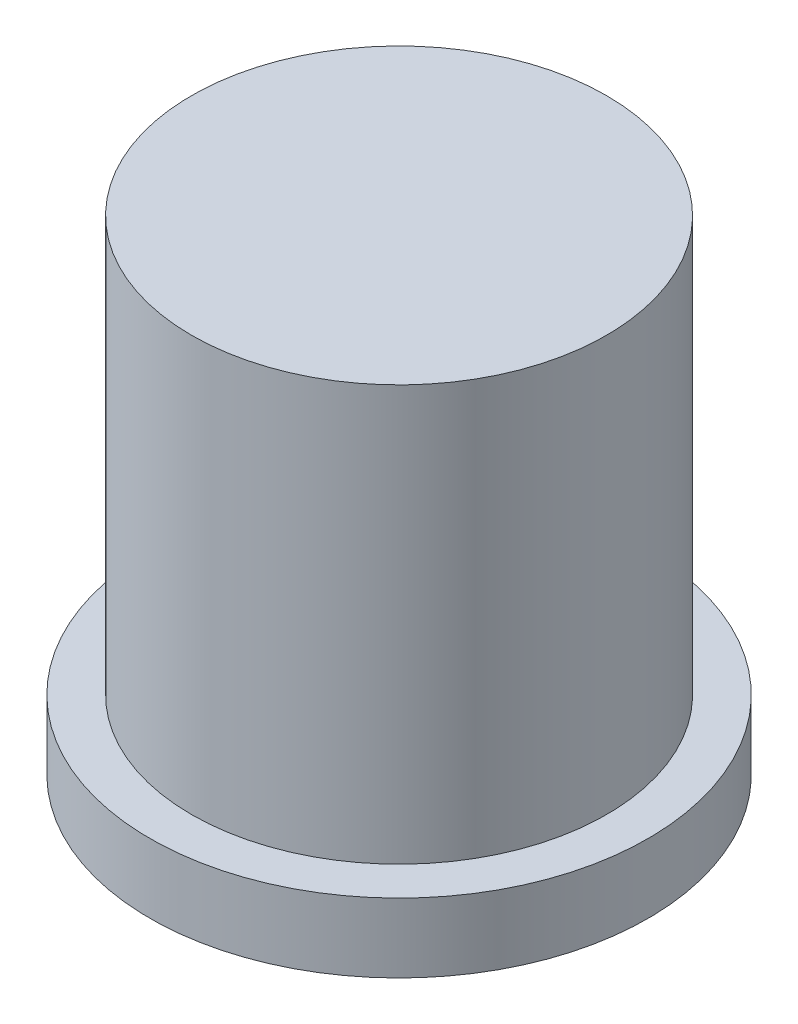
ISO-10303-21;
HEADER;
FILE_DESCRIPTION(('STEP AP214'),'2;1');
FILE_NAME('part.step','',(''),(''),'','','');
FILE_SCHEMA(('AUTOMOTIVE_DESIGN { 1 0 10303 214 1 1 1 1 }'));
ENDSEC;
DATA;
#1=APPLICATION_CONTEXT('core data for automotive mechanical design processes');
#2=APPLICATION_PROTOCOL_DEFINITION('international standard','automotive_design',2000,#1);
#3=PRODUCT_CONTEXT('',#1,'mechanical');
#4=PRODUCT('Part','Part','',(#3));
#5=PRODUCT_RELATED_PRODUCT_CATEGORY('part','',(#4));
#6=PRODUCT_DEFINITION_FORMATION('','',#4);
#7=PRODUCT_DEFINITION_CONTEXT('part definition',#1,'design');
#8=PRODUCT_DEFINITION('design','',#6,#7);
#9=PRODUCT_DEFINITION_SHAPE('','',#8);
#10=(LENGTH_UNIT() NAMED_UNIT(*) SI_UNIT(.MILLI.,.METRE.));
#11=(NAMED_UNIT(*) PLANE_ANGLE_UNIT() SI_UNIT($,.RADIAN.));
#12=(NAMED_UNIT(*) SI_UNIT($,.STERADIAN.) SOLID_ANGLE_UNIT());
#13=UNCERTAINTY_MEASURE_WITH_UNIT(LENGTH_MEASURE(1.E-05),#10,'distance_accuracy_value','');
#14=(GEOMETRIC_REPRESENTATION_CONTEXT(3) GLOBAL_UNCERTAINTY_ASSIGNED_CONTEXT((#13)) GLOBAL_UNIT_ASSIGNED_CONTEXT((#10,
#11,#12)) REPRESENTATION_CONTEXT('',''));
#15=CARTESIAN_POINT('',(0.,0.,0.));
#16=DIRECTION('',(0.,0.,1.));
#17=DIRECTION('',(1.,0.,0.));
#18=AXIS2_PLACEMENT_3D('',#15,#16,#17);
#19=CARTESIAN_POINT('',(0.,0.,0.));
#20=DIRECTION('',(0.,1.,0.));
#21=DIRECTION('',(0.,0.,1.));
#22=AXIS2_PLACEMENT_3D('',#19,#20,#21);
#23=PLANE('',#22);
#24=CARTESIAN_POINT('',(0.,0.,0.));
#25=DIRECTION('',(0.,-1.,0.));
#26=DIRECTION('',(0.,0.,-1.));
#27=AXIS2_PLACEMENT_3D('',#24,#25,#26);
#28=CIRCLE('',#27,11.43);
#29=CARTESIAN_POINT('',(0.,0.,-11.43));
#30=VERTEX_POINT('',#29);
#31=EDGE_CURVE('E10',#30,#30,#28,.T.);
#32=ORIENTED_EDGE('',*,*,#31,.T.);
#33=EDGE_LOOP('',(#32));
#34=FACE_BOUND('',#33,.T.);
#35=ADVANCED_FACE('F35',(#34),#23,.F.);
#36=CARTESIAN_POINT('',(0.,0.,0.));
#37=DIRECTION('',(0.,-1.,0.));
#38=DIRECTION('',(0.,0.,-1.));
#39=AXIS2_PLACEMENT_3D('',#36,#37,#38);
#40=CYLINDRICAL_SURFACE('',#39,11.43);
#41=ORIENTED_EDGE('',*,*,#31,.F.);
#42=EDGE_LOOP('',(#41));
#43=FACE_BOUND('',#42,.T.);
#44=CARTESIAN_POINT('',(0.,3.175,0.));
#45=DIRECTION('',(0.,-1.,0.));
#46=DIRECTION('',(0.,0.,-1.));
#47=AXIS2_PLACEMENT_3D('',#44,#45,#46);
#48=CIRCLE('',#47,11.43);
#49=CARTESIAN_POINT('',(0.,3.175,-11.43));
#50=VERTEX_POINT('',#49);
#51=EDGE_CURVE('E41',#50,#50,#48,.T.);
#52=ORIENTED_EDGE('',*,*,#51,.T.);
#53=EDGE_LOOP('',(#52));
#54=FACE_BOUND('',#53,.T.);
#55=ADVANCED_FACE('F67',(#43,#54),#40,.T.);
#56=CARTESIAN_POINT('',(-11.43,3.175,0.));
#57=DIRECTION('',(0.,-1.,0.));
#58=DIRECTION('',(0.,0.,-1.));
#59=AXIS2_PLACEMENT_3D('',#56,#57,#58);
#60=PLANE('',#59);
#61=ORIENTED_EDGE('',*,*,#51,.F.);
#62=EDGE_LOOP('',(#61));
#63=FACE_BOUND('',#62,.T.);
#64=CARTESIAN_POINT('',(0.,3.175,0.));
#65=DIRECTION('',(0.,-1.,0.));
#66=DIRECTION('',(0.,0.,-1.));
#67=AXIS2_PLACEMENT_3D('',#64,#65,#66);
#68=CIRCLE('',#67,9.525);
#69=CARTESIAN_POINT('',(0.,3.175,-9.525));
#70=VERTEX_POINT('',#69);
#71=EDGE_CURVE('E45',#70,#70,#68,.T.);
#72=ORIENTED_EDGE('',*,*,#71,.T.);
#73=EDGE_LOOP('',(#72));
#74=FACE_BOUND('',#73,.T.);
#75=ADVANCED_FACE('F63',(#63,#74),#60,.F.);
#76=CARTESIAN_POINT('',(0.,0.,0.));
#77=DIRECTION('',(0.,-1.,0.));
#78=DIRECTION('',(0.,0.,-1.));
#79=AXIS2_PLACEMENT_3D('',#76,#77,#78);
#80=CYLINDRICAL_SURFACE('',#79,9.525);
#81=ORIENTED_EDGE('',*,*,#71,.F.);
#82=EDGE_LOOP('',(#81));
#83=FACE_BOUND('',#82,.T.);
#84=CARTESIAN_POINT('',(0.,22.225,0.));
#85=DIRECTION('',(0.,-1.,0.));
#86=DIRECTION('',(0.,0.,-1.));
#87=AXIS2_PLACEMENT_3D('',#84,#85,#86);
#88=CIRCLE('',#87,9.525);
#89=CARTESIAN_POINT('',(0.,22.225,-9.525));
#90=VERTEX_POINT('',#89);
#91=EDGE_CURVE('E49',#90,#90,#88,.T.);
#92=ORIENTED_EDGE('',*,*,#91,.T.);
#93=EDGE_LOOP('',(#92));
#94=FACE_BOUND('',#93,.T.);
#95=ADVANCED_FACE('F55',(#83,#94),#80,.T.);
#96=CARTESIAN_POINT('',(-9.525,22.225,0.));
#97=DIRECTION('',(0.,-1.,0.));
#98=DIRECTION('',(0.,0.,-1.));
#99=AXIS2_PLACEMENT_3D('',#96,#97,#98);
#100=PLANE('',#99);
#101=ORIENTED_EDGE('',*,*,#91,.F.);
#102=EDGE_LOOP('',(#101));
#103=FACE_BOUND('',#102,.T.);
#104=ADVANCED_FACE('F57',(#103),#100,.F.);
#105=CLOSED_SHELL('',(#35,#55,#75,#95,#104));
#106=MANIFOLD_SOLID_BREP('B2',#105);
#107=ADVANCED_BREP_SHAPE_REPRESENTATION('',(#18,#106),#14);
#108=SHAPE_DEFINITION_REPRESENTATION(#9,#107);
ENDSEC;
END-ISO-10303-21;
